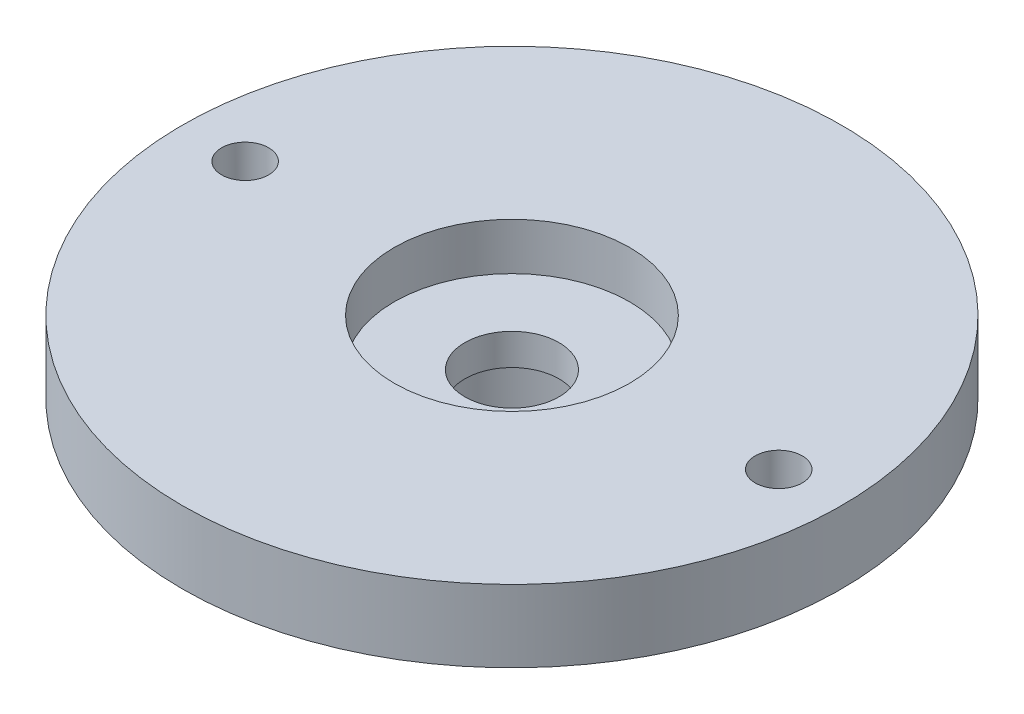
ISO-10303-21;
HEADER;
FILE_DESCRIPTION(('STEP AP214'),'2;1');
FILE_NAME('part.step','',(''),(''),'','','');
FILE_SCHEMA(('AUTOMOTIVE_DESIGN { 1 0 10303 214 1 1 1 1 }'));
ENDSEC;
DATA;
#1=APPLICATION_CONTEXT('core data for automotive mechanical design processes');
#2=APPLICATION_PROTOCOL_DEFINITION('international standard','automotive_design',2000,#1);
#3=PRODUCT_CONTEXT('',#1,'mechanical');
#4=PRODUCT('Part','Part','',(#3));
#5=PRODUCT_RELATED_PRODUCT_CATEGORY('part','',(#4));
#6=PRODUCT_DEFINITION_FORMATION('','',#4);
#7=PRODUCT_DEFINITION_CONTEXT('part definition',#1,'design');
#8=PRODUCT_DEFINITION('design','',#6,#7);
#9=PRODUCT_DEFINITION_SHAPE('','',#8);
#10=(LENGTH_UNIT() NAMED_UNIT(*) SI_UNIT(.MILLI.,.METRE.));
#11=(NAMED_UNIT(*) PLANE_ANGLE_UNIT() SI_UNIT($,.RADIAN.));
#12=(NAMED_UNIT(*) SI_UNIT($,.STERADIAN.) SOLID_ANGLE_UNIT());
#13=UNCERTAINTY_MEASURE_WITH_UNIT(LENGTH_MEASURE(1.E-05),#10,'distance_accuracy_value','');
#14=(GEOMETRIC_REPRESENTATION_CONTEXT(3) GLOBAL_UNCERTAINTY_ASSIGNED_CONTEXT((#13)) GLOBAL_UNIT_ASSIGNED_CONTEXT((#10,
#11,#12)) REPRESENTATION_CONTEXT('',''));
#15=CARTESIAN_POINT('',(0.,0.,0.));
#16=DIRECTION('',(0.,0.,1.));
#17=DIRECTION('',(1.,0.,0.));
#18=AXIS2_PLACEMENT_3D('',#15,#16,#17);
#19=CARTESIAN_POINT('',(10.5,5.5,0.));
#20=DIRECTION('',(0.,-1.,0.));
#21=DIRECTION('',(0.,0.,-1.));
#22=AXIS2_PLACEMENT_3D('',#19,#20,#21);
#23=PLANE('',#22);
#24=CARTESIAN_POINT('',(-8.5,5.5,0.));
#25=DIRECTION('',(0.,1.,0.));
#26=DIRECTION('',(0.,0.,-1.));
#27=AXIS2_PLACEMENT_3D('',#24,#25,#26);
#28=CIRCLE('',#27,0.75);
#29=CARTESIAN_POINT('',(-8.5,5.5,-0.75));
#30=VERTEX_POINT('',#29);
#31=EDGE_CURVE('E60',#30,#30,#28,.T.);
#32=ORIENTED_EDGE('',*,*,#31,.F.);
#33=EDGE_LOOP('',(#32));
#34=FACE_BOUND('',#33,.T.);
#35=CARTESIAN_POINT('',(8.5,5.5,0.));
#36=DIRECTION('',(0.,1.,0.));
#37=DIRECTION('',(0.,0.,1.));
#38=AXIS2_PLACEMENT_3D('',#35,#36,#37);
#39=CIRCLE('',#38,0.75);
#40=CARTESIAN_POINT('',(8.5,5.5,0.75));
#41=VERTEX_POINT('',#40);
#42=EDGE_CURVE('E49',#41,#41,#39,.T.);
#43=ORIENTED_EDGE('',*,*,#42,.F.);
#44=EDGE_LOOP('',(#43));
#45=FACE_BOUND('',#44,.T.);
#46=CARTESIAN_POINT('',(0.,5.5,0.));
#47=DIRECTION('',(0.,1.,0.));
#48=DIRECTION('',(0.,0.,1.));
#49=AXIS2_PLACEMENT_3D('',#46,#47,#48);
#50=CIRCLE('',#49,3.75);
#51=CARTESIAN_POINT('',(0.,5.5,3.75));
#52=VERTEX_POINT('',#51);
#53=EDGE_CURVE('E10',#52,#52,#50,.T.);
#54=ORIENTED_EDGE('',*,*,#53,.F.);
#55=EDGE_LOOP('',(#54));
#56=FACE_BOUND('',#55,.T.);
#57=CARTESIAN_POINT('',(0.,5.5,0.));
#58=DIRECTION('',(0.,1.,0.));
#59=DIRECTION('',(0.,0.,1.));
#60=AXIS2_PLACEMENT_3D('',#57,#58,#59);
#61=CIRCLE('',#60,10.5);
#62=CARTESIAN_POINT('',(0.,5.5,10.5));
#63=VERTEX_POINT('',#62);
#64=EDGE_CURVE('E48',#63,#63,#61,.T.);
#65=ORIENTED_EDGE('',*,*,#64,.T.);
#66=EDGE_LOOP('',(#65));
#67=FACE_BOUND('',#66,.T.);
#68=ADVANCED_FACE('F31',(#34,#45,#56,#67),#23,.F.);
#69=CARTESIAN_POINT('',(0.,9.56085964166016,0.));
#70=DIRECTION('',(0.,1.,0.));
#71=DIRECTION('',(0.,0.,1.));
#72=AXIS2_PLACEMENT_3D('',#69,#70,#71);
#73=CYLINDRICAL_SURFACE('',#72,3.75);
#74=CARTESIAN_POINT('',(0.,4.,0.));
#75=DIRECTION('',(0.,1.,0.));
#76=DIRECTION('',(0.,0.,1.));
#77=AXIS2_PLACEMENT_3D('',#74,#75,#76);
#78=CIRCLE('',#77,3.75);
#79=CARTESIAN_POINT('',(0.,4.,3.75));
#80=VERTEX_POINT('',#79);
#81=EDGE_CURVE('E38',#80,#80,#78,.T.);
#82=ORIENTED_EDGE('',*,*,#81,.F.);
#83=EDGE_LOOP('',(#82));
#84=FACE_BOUND('',#83,.T.);
#85=ORIENTED_EDGE('',*,*,#53,.T.);
#86=EDGE_LOOP('',(#85));
#87=FACE_BOUND('',#86,.T.);
#88=ADVANCED_FACE('F87',(#84,#87),#73,.F.);
#89=CARTESIAN_POINT('',(3.75,4.,0.));
#90=DIRECTION('',(0.,-1.,0.));
#91=DIRECTION('',(0.,0.,-1.));
#92=AXIS2_PLACEMENT_3D('',#89,#90,#91);
#93=PLANE('',#92);
#94=CARTESIAN_POINT('',(0.,4.,0.));
#95=DIRECTION('',(0.,1.,0.));
#96=DIRECTION('',(0.,0.,1.));
#97=AXIS2_PLACEMENT_3D('',#94,#95,#96);
#98=CIRCLE('',#97,1.5);
#99=CARTESIAN_POINT('',(0.,4.,1.5));
#100=VERTEX_POINT('',#99);
#101=EDGE_CURVE('E43',#100,#100,#98,.T.);
#102=ORIENTED_EDGE('',*,*,#101,.F.);
#103=EDGE_LOOP('',(#102));
#104=FACE_BOUND('',#103,.T.);
#105=ORIENTED_EDGE('',*,*,#81,.T.);
#106=EDGE_LOOP('',(#105));
#107=FACE_BOUND('',#106,.T.);
#108=ADVANCED_FACE('F84',(#104,#107),#93,.F.);
#109=CARTESIAN_POINT('',(0.,9.56085964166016,0.));
#110=DIRECTION('',(0.,1.,0.));
#111=DIRECTION('',(0.,0.,1.));
#112=AXIS2_PLACEMENT_3D('',#109,#110,#111);
#113=CYLINDRICAL_SURFACE('',#112,1.5);
#114=CARTESIAN_POINT('',(0.,3.,0.));
#115=DIRECTION('',(0.,1.,0.));
#116=DIRECTION('',(0.,0.,1.));
#117=AXIS2_PLACEMENT_3D('',#114,#115,#116);
#118=CIRCLE('',#117,1.50000000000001);
#119=CARTESIAN_POINT('',(0.,3.,1.50000000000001));
#120=VERTEX_POINT('',#119);
#121=EDGE_CURVE('E77',#120,#120,#118,.T.);
#122=ORIENTED_EDGE('',*,*,#121,.F.);
#123=EDGE_LOOP('',(#122));
#124=FACE_BOUND('',#123,.T.);
#125=ORIENTED_EDGE('',*,*,#101,.T.);
#126=EDGE_LOOP('',(#125));
#127=FACE_BOUND('',#126,.T.);
#128=ADVANCED_FACE('F82',(#124,#127),#113,.F.);
#129=CARTESIAN_POINT('',(1.50000000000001,3.,0.));
#130=DIRECTION('',(0.,1.,0.));
#131=DIRECTION('',(0.,0.,1.));
#132=AXIS2_PLACEMENT_3D('',#129,#130,#131);
#133=PLANE('',#132);
#134=CARTESIAN_POINT('',(0.,3.,0.));
#135=DIRECTION('',(0.,1.,0.));
#136=DIRECTION('',(0.,0.,1.));
#137=AXIS2_PLACEMENT_3D('',#134,#135,#136);
#138=CIRCLE('',#137,3.00000000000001);
#139=CARTESIAN_POINT('',(0.,3.,3.00000000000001));
#140=VERTEX_POINT('',#139);
#141=EDGE_CURVE('E74',#140,#140,#138,.T.);
#142=ORIENTED_EDGE('',*,*,#141,.F.);
#143=EDGE_LOOP('',(#142));
#144=FACE_BOUND('',#143,.T.);
#145=ORIENTED_EDGE('',*,*,#121,.T.);
#146=EDGE_LOOP('',(#145));
#147=FACE_BOUND('',#146,.T.);
#148=ADVANCED_FACE('F99',(#144,#147),#133,.F.);
#149=CARTESIAN_POINT('',(0.,9.56085964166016,0.));
#150=DIRECTION('',(0.,1.,0.));
#151=DIRECTION('',(0.,0.,1.));
#152=AXIS2_PLACEMENT_3D('',#149,#150,#151);
#153=CYLINDRICAL_SURFACE('',#152,3.00000000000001);
#154=CARTESIAN_POINT('',(0.,0.,0.));
#155=DIRECTION('',(0.,1.,0.));
#156=DIRECTION('',(0.,0.,1.));
#157=AXIS2_PLACEMENT_3D('',#154,#155,#156);
#158=CIRCLE('',#157,3.00000000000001);
#159=CARTESIAN_POINT('',(0.,0.,3.00000000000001));
#160=VERTEX_POINT('',#159);
#161=EDGE_CURVE('E71',#160,#160,#158,.T.);
#162=ORIENTED_EDGE('',*,*,#161,.F.);
#163=EDGE_LOOP('',(#162));
#164=FACE_BOUND('',#163,.T.);
#165=ORIENTED_EDGE('',*,*,#141,.T.);
#166=EDGE_LOOP('',(#165));
#167=FACE_BOUND('',#166,.T.);
#168=ADVANCED_FACE('F103',(#164,#167),#153,.F.);
#169=CARTESIAN_POINT('',(3.00000000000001,0.,0.));
#170=DIRECTION('',(0.,1.,0.));
#171=DIRECTION('',(0.,0.,1.));
#172=AXIS2_PLACEMENT_3D('',#169,#170,#171);
#173=PLANE('',#172);
#174=CARTESIAN_POINT('',(0.,0.,0.));
#175=DIRECTION('',(0.,1.,0.));
#176=DIRECTION('',(0.,0.,1.));
#177=AXIS2_PLACEMENT_3D('',#174,#175,#176);
#178=CIRCLE('',#177,4.5);
#179=CARTESIAN_POINT('',(0.,0.,4.5));
#180=VERTEX_POINT('',#179);
#181=EDGE_CURVE('E68',#180,#180,#178,.T.);
#182=ORIENTED_EDGE('',*,*,#181,.F.);
#183=EDGE_LOOP('',(#182));
#184=FACE_BOUND('',#183,.T.);
#185=ORIENTED_EDGE('',*,*,#161,.T.);
#186=EDGE_LOOP('',(#185));
#187=FACE_BOUND('',#186,.T.);
#188=ADVANCED_FACE('F107',(#184,#187),#173,.F.);
#189=CARTESIAN_POINT('',(0.,9.56085964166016,0.));
#190=DIRECTION('',(0.,1.,0.));
#191=DIRECTION('',(0.,0.,1.));
#192=AXIS2_PLACEMENT_3D('',#189,#190,#191);
#193=CYLINDRICAL_SURFACE('',#192,4.5);
#194=CARTESIAN_POINT('',(0.,3.2,0.));
#195=DIRECTION('',(0.,1.,0.));
#196=DIRECTION('',(0.,0.,1.));
#197=AXIS2_PLACEMENT_3D('',#194,#195,#196);
#198=CIRCLE('',#197,4.5);
#199=CARTESIAN_POINT('',(0.,3.2,4.5));
#200=VERTEX_POINT('',#199);
#201=EDGE_CURVE('E65',#200,#200,#198,.T.);
#202=ORIENTED_EDGE('',*,*,#201,.F.);
#203=EDGE_LOOP('',(#202));
#204=FACE_BOUND('',#203,.T.);
#205=ORIENTED_EDGE('',*,*,#181,.T.);
#206=EDGE_LOOP('',(#205));
#207=FACE_BOUND('',#206,.T.);
#208=ADVANCED_FACE('F111',(#204,#207),#193,.T.);
#209=CARTESIAN_POINT('',(4.5,3.2,0.));
#210=DIRECTION('',(0.,1.,0.));
#211=DIRECTION('',(0.,0.,1.));
#212=AXIS2_PLACEMENT_3D('',#209,#210,#211);
#213=PLANE('',#212);
#214=CARTESIAN_POINT('',(-8.5,3.2,0.));
#215=DIRECTION('',(0.,1.,0.));
#216=DIRECTION('',(0.,0.,1.));
#217=AXIS2_PLACEMENT_3D('',#214,#215,#216);
#218=CIRCLE('',#217,0.75);
#219=CARTESIAN_POINT('',(-8.5,3.2,0.75));
#220=VERTEX_POINT('',#219);
#221=EDGE_CURVE('E34',#220,#220,#218,.T.);
#222=ORIENTED_EDGE('',*,*,#221,.T.);
#223=EDGE_LOOP('',(#222));
#224=FACE_BOUND('',#223,.T.);
#225=CARTESIAN_POINT('',(8.5,3.2,0.));
#226=DIRECTION('',(0.,1.,0.));
#227=DIRECTION('',(0.,0.,1.));
#228=AXIS2_PLACEMENT_3D('',#225,#226,#227);
#229=CIRCLE('',#228,0.75);
#230=CARTESIAN_POINT('',(8.5,3.2,0.75));
#231=VERTEX_POINT('',#230);
#232=EDGE_CURVE('E46',#231,#231,#229,.T.);
#233=ORIENTED_EDGE('',*,*,#232,.T.);
#234=EDGE_LOOP('',(#233));
#235=FACE_BOUND('',#234,.T.);
#236=CARTESIAN_POINT('',(0.,3.2,0.));
#237=DIRECTION('',(0.,1.,0.));
#238=DIRECTION('',(0.,0.,1.));
#239=AXIS2_PLACEMENT_3D('',#236,#237,#238);
#240=CIRCLE('',#239,10.5);
#241=CARTESIAN_POINT('',(0.,3.2,10.5));
#242=VERTEX_POINT('',#241);
#243=EDGE_CURVE('E53',#242,#242,#240,.T.);
#244=ORIENTED_EDGE('',*,*,#243,.F.);
#245=EDGE_LOOP('',(#244));
#246=FACE_BOUND('',#245,.T.);
#247=ORIENTED_EDGE('',*,*,#201,.T.);
#248=EDGE_LOOP('',(#247));
#249=FACE_BOUND('',#248,.T.);
#250=ADVANCED_FACE('F115',(#224,#235,#246,#249),#213,.F.);
#251=CARTESIAN_POINT('',(0.,9.56085964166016,0.));
#252=DIRECTION('',(0.,1.,0.));
#253=DIRECTION('',(0.,0.,1.));
#254=AXIS2_PLACEMENT_3D('',#251,#252,#253);
#255=CYLINDRICAL_SURFACE('',#254,10.5);
#256=ORIENTED_EDGE('',*,*,#64,.F.);
#257=EDGE_LOOP('',(#256));
#258=FACE_BOUND('',#257,.T.);
#259=ORIENTED_EDGE('',*,*,#243,.T.);
#260=EDGE_LOOP('',(#259));
#261=FACE_BOUND('',#260,.T.);
#262=ADVANCED_FACE('F119',(#258,#261),#255,.T.);
#263=CARTESIAN_POINT('',(8.5,0.,0.));
#264=DIRECTION('',(0.,1.,0.));
#265=DIRECTION('',(0.,0.,1.));
#266=AXIS2_PLACEMENT_3D('',#263,#264,#265);
#267=CYLINDRICAL_SURFACE('',#266,0.75);
#268=ORIENTED_EDGE('',*,*,#42,.T.);
#269=EDGE_LOOP('',(#268));
#270=FACE_BOUND('',#269,.T.);
#271=ORIENTED_EDGE('',*,*,#232,.F.);
#272=EDGE_LOOP('',(#271));
#273=FACE_BOUND('',#272,.T.);
#274=ADVANCED_FACE('F123',(#270,#273),#267,.F.);
#275=CARTESIAN_POINT('',(-8.5,0.,0.));
#276=DIRECTION('',(0.,1.,0.));
#277=DIRECTION('',(0.,0.,1.));
#278=AXIS2_PLACEMENT_3D('',#275,#276,#277);
#279=CYLINDRICAL_SURFACE('',#278,0.75);
#280=ORIENTED_EDGE('',*,*,#31,.T.);
#281=EDGE_LOOP('',(#280));
#282=FACE_BOUND('',#281,.T.);
#283=ORIENTED_EDGE('',*,*,#221,.F.);
#284=EDGE_LOOP('',(#283));
#285=FACE_BOUND('',#284,.T.);
#286=ADVANCED_FACE('F127',(#282,#285),#279,.F.);
#287=CLOSED_SHELL('',(#68,#88,#108,#128,#148,#168,#188,#208,#250,#262,#274,#286));
#288=MANIFOLD_SOLID_BREP('B2',#287);
#289=ADVANCED_BREP_SHAPE_REPRESENTATION('',(#18,#288),#14);
#290=SHAPE_DEFINITION_REPRESENTATION(#9,#289);
ENDSEC;
END-ISO-10303-21;
